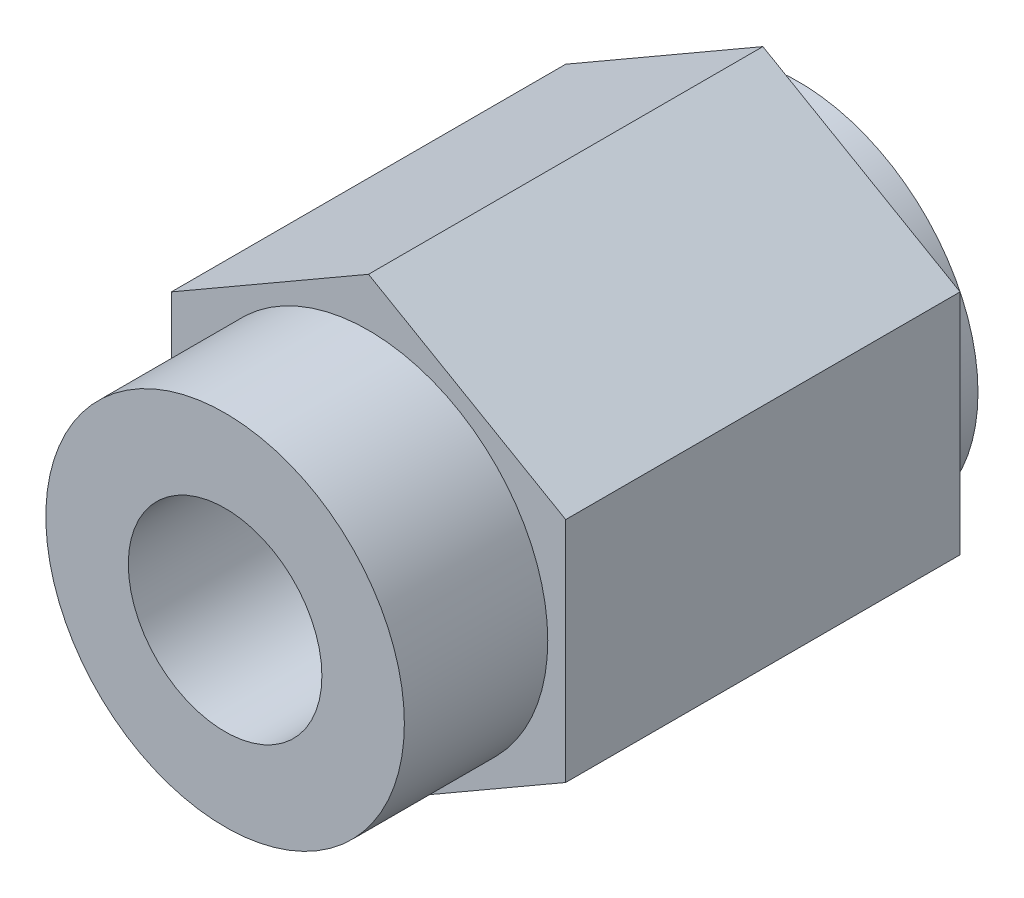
ISO-10303-21;
HEADER;
FILE_DESCRIPTION(('STEP AP214'),'2;1');
FILE_NAME('part.step','',(''),(''),'','','');
FILE_SCHEMA(('AUTOMOTIVE_DESIGN { 1 0 10303 214 1 1 1 1 }'));
ENDSEC;
DATA;
#1=APPLICATION_CONTEXT('core data for automotive mechanical design processes');
#2=APPLICATION_PROTOCOL_DEFINITION('international standard','automotive_design',2000,#1);
#3=PRODUCT_CONTEXT('',#1,'mechanical');
#4=PRODUCT('Part','Part','',(#3));
#5=PRODUCT_RELATED_PRODUCT_CATEGORY('part','',(#4));
#6=PRODUCT_DEFINITION_FORMATION('','',#4);
#7=PRODUCT_DEFINITION_CONTEXT('part definition',#1,'design');
#8=PRODUCT_DEFINITION('design','',#6,#7);
#9=PRODUCT_DEFINITION_SHAPE('','',#8);
#10=(LENGTH_UNIT() NAMED_UNIT(*) SI_UNIT(.MILLI.,.METRE.));
#11=(NAMED_UNIT(*) PLANE_ANGLE_UNIT() SI_UNIT($,.RADIAN.));
#12=(NAMED_UNIT(*) SI_UNIT($,.STERADIAN.) SOLID_ANGLE_UNIT());
#13=UNCERTAINTY_MEASURE_WITH_UNIT(LENGTH_MEASURE(1.E-05),#10,'distance_accuracy_value','');
#14=(GEOMETRIC_REPRESENTATION_CONTEXT(3) GLOBAL_UNCERTAINTY_ASSIGNED_CONTEXT((#13)) GLOBAL_UNIT_ASSIGNED_CONTEXT((#10,
#11,#12)) REPRESENTATION_CONTEXT('',''));
#15=CARTESIAN_POINT('',(0.,0.,0.));
#16=DIRECTION('',(0.,0.,1.));
#17=DIRECTION('',(1.,0.,0.));
#18=AXIS2_PLACEMENT_3D('',#15,#16,#17);
#19=CARTESIAN_POINT('',(27.5,15.8771324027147,55.));
#20=DIRECTION('',(-0.5,-0.866025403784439,0.));
#21=DIRECTION('',(0.866025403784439,-0.5,0.));
#22=AXIS2_PLACEMENT_3D('',#19,#20,#21);
#23=PLANE('',#22);
#24=DIRECTION('',(-0.866025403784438,0.5,0.));
#25=VECTOR('',#24,1.);
#26=CARTESIAN_POINT('',(27.5,15.8771324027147,0.));
#27=LINE('',#26,#25);
#28=CARTESIAN_POINT('',(27.5,15.8771324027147,0.));
#29=VERTEX_POINT('',#28);
#30=CARTESIAN_POINT('',(0.,31.7542648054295,0.));
#31=VERTEX_POINT('',#30);
#32=EDGE_CURVE('E121',#29,#31,#27,.T.);
#33=ORIENTED_EDGE('',*,*,#32,.T.);
#34=DIRECTION('',(0.,0.,-1.));
#35=VECTOR('',#34,1.);
#36=CARTESIAN_POINT('',(0.,31.7542648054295,55.));
#37=LINE('',#36,#35);
#38=CARTESIAN_POINT('',(0.,31.7542648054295,55.));
#39=VERTEX_POINT('',#38);
#40=EDGE_CURVE('E44',#39,#31,#37,.T.);
#41=ORIENTED_EDGE('',*,*,#40,.F.);
#42=DIRECTION('',(-0.866025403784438,0.5,0.));
#43=VECTOR('',#42,1.);
#44=CARTESIAN_POINT('',(27.5,15.8771324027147,55.));
#45=LINE('',#44,#43);
#46=CARTESIAN_POINT('',(27.5,15.8771324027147,55.));
#47=VERTEX_POINT('',#46);
#48=EDGE_CURVE('E132',#47,#39,#45,.T.);
#49=ORIENTED_EDGE('',*,*,#48,.F.);
#50=DIRECTION('',(0.,0.,-1.));
#51=VECTOR('',#50,1.);
#52=CARTESIAN_POINT('',(27.5,15.8771324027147,55.));
#53=LINE('',#52,#51);
#54=EDGE_CURVE('E117',#47,#29,#53,.T.);
#55=ORIENTED_EDGE('',*,*,#54,.T.);
#56=EDGE_LOOP('',(#33,#41,#49,#55));
#57=FACE_BOUND('',#56,.T.);
#58=ADVANCED_FACE('F36',(#57),#23,.F.);
#59=CARTESIAN_POINT('',(0.,31.7542648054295,55.));
#60=DIRECTION('',(0.5,-0.866025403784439,0.));
#61=DIRECTION('',(0.866025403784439,0.5,0.));
#62=AXIS2_PLACEMENT_3D('',#59,#60,#61);
#63=PLANE('',#62);
#64=DIRECTION('',(-0.866025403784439,-0.5,0.));
#65=VECTOR('',#64,1.);
#66=CARTESIAN_POINT('',(0.,31.7542648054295,0.));
#67=LINE('',#66,#65);
#68=CARTESIAN_POINT('',(-27.5,15.8771324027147,0.));
#69=VERTEX_POINT('',#68);
#70=EDGE_CURVE('E124',#31,#69,#67,.T.);
#71=ORIENTED_EDGE('',*,*,#70,.T.);
#72=DIRECTION('',(0.,0.,-1.));
#73=VECTOR('',#72,1.);
#74=CARTESIAN_POINT('',(-27.5,15.8771324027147,55.));
#75=LINE('',#74,#73);
#76=CARTESIAN_POINT('',(-27.5,15.8771324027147,55.));
#77=VERTEX_POINT('',#76);
#78=EDGE_CURVE('E136',#77,#69,#75,.T.);
#79=ORIENTED_EDGE('',*,*,#78,.F.);
#80=DIRECTION('',(-0.866025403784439,-0.5,0.));
#81=VECTOR('',#80,1.);
#82=CARTESIAN_POINT('',(0.,31.7542648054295,55.));
#83=LINE('',#82,#81);
#84=EDGE_CURVE('E90',#39,#77,#83,.T.);
#85=ORIENTED_EDGE('',*,*,#84,.F.);
#86=ORIENTED_EDGE('',*,*,#40,.T.);
#87=EDGE_LOOP('',(#71,#79,#85,#86));
#88=FACE_BOUND('',#87,.T.);
#89=ADVANCED_FACE('F139',(#88),#63,.F.);
#90=CARTESIAN_POINT('',(-27.5,15.8771324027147,55.));
#91=DIRECTION('',(1.,0.,0.));
#92=DIRECTION('',(0.,1.,0.));
#93=AXIS2_PLACEMENT_3D('',#90,#91,#92);
#94=PLANE('',#93);
#95=DIRECTION('',(0.,-1.,0.));
#96=VECTOR('',#95,1.);
#97=CARTESIAN_POINT('',(-27.5,15.8771324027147,0.));
#98=LINE('',#97,#96);
#99=CARTESIAN_POINT('',(-27.5,-15.8771324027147,0.));
#100=VERTEX_POINT('',#99);
#101=EDGE_CURVE('E127',#69,#100,#98,.T.);
#102=ORIENTED_EDGE('',*,*,#101,.T.);
#103=DIRECTION('',(0.,0.,-1.));
#104=VECTOR('',#103,1.);
#105=CARTESIAN_POINT('',(-27.5,-15.8771324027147,55.));
#106=LINE('',#105,#104);
#107=CARTESIAN_POINT('',(-27.5,-15.8771324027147,55.));
#108=VERTEX_POINT('',#107);
#109=EDGE_CURVE('E112',#108,#100,#106,.T.);
#110=ORIENTED_EDGE('',*,*,#109,.F.);
#111=DIRECTION('',(0.,-1.,0.));
#112=VECTOR('',#111,1.);
#113=CARTESIAN_POINT('',(-27.5,15.8771324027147,55.));
#114=LINE('',#113,#112);
#115=EDGE_CURVE('E103',#77,#108,#114,.T.);
#116=ORIENTED_EDGE('',*,*,#115,.F.);
#117=ORIENTED_EDGE('',*,*,#78,.T.);
#118=EDGE_LOOP('',(#102,#110,#116,#117));
#119=FACE_BOUND('',#118,.T.);
#120=ADVANCED_FACE('F147',(#119),#94,.F.);
#121=CARTESIAN_POINT('',(-27.5,-15.8771324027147,55.));
#122=DIRECTION('',(0.5,0.866025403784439,0.));
#123=DIRECTION('',(-0.866025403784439,0.5,0.));
#124=AXIS2_PLACEMENT_3D('',#121,#122,#123);
#125=PLANE('',#124);
#126=DIRECTION('',(0.866025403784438,-0.5,0.));
#127=VECTOR('',#126,1.);
#128=CARTESIAN_POINT('',(-27.5,-15.8771324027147,0.));
#129=LINE('',#128,#127);
#130=CARTESIAN_POINT('',(0.,-31.7542648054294,0.));
#131=VERTEX_POINT('',#130);
#132=EDGE_CURVE('E111',#100,#131,#129,.T.);
#133=ORIENTED_EDGE('',*,*,#132,.T.);
#134=DIRECTION('',(0.,0.,-1.));
#135=VECTOR('',#134,1.);
#136=CARTESIAN_POINT('',(0.,-31.7542648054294,55.));
#137=LINE('',#136,#135);
#138=CARTESIAN_POINT('',(0.,-31.7542648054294,55.));
#139=VERTEX_POINT('',#138);
#140=EDGE_CURVE('E108',#139,#131,#137,.T.);
#141=ORIENTED_EDGE('',*,*,#140,.F.);
#142=DIRECTION('',(0.866025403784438,-0.5,0.));
#143=VECTOR('',#142,1.);
#144=CARTESIAN_POINT('',(-27.5,-15.8771324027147,55.));
#145=LINE('',#144,#143);
#146=EDGE_CURVE('E97',#108,#139,#145,.T.);
#147=ORIENTED_EDGE('',*,*,#146,.F.);
#148=ORIENTED_EDGE('',*,*,#109,.T.);
#149=EDGE_LOOP('',(#133,#141,#147,#148));
#150=FACE_BOUND('',#149,.T.);
#151=ADVANCED_FACE('F109',(#150),#125,.F.);
#152=CARTESIAN_POINT('',(0.,-31.7542648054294,55.));
#153=DIRECTION('',(-0.5,0.866025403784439,0.));
#154=DIRECTION('',(-0.866025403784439,-0.5,0.));
#155=AXIS2_PLACEMENT_3D('',#152,#153,#154);
#156=PLANE('',#155);
#157=DIRECTION('',(0.866025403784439,0.5,0.));
#158=VECTOR('',#157,1.);
#159=CARTESIAN_POINT('',(0.,-31.7542648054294,0.));
#160=LINE('',#159,#158);
#161=CARTESIAN_POINT('',(27.5,-15.8771324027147,0.));
#162=VERTEX_POINT('',#161);
#163=EDGE_CURVE('E75',#131,#162,#160,.T.);
#164=ORIENTED_EDGE('',*,*,#163,.T.);
#165=DIRECTION('',(0.,0.,-1.));
#166=VECTOR('',#165,1.);
#167=CARTESIAN_POINT('',(27.5,-15.8771324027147,55.));
#168=LINE('',#167,#166);
#169=CARTESIAN_POINT('',(27.5,-15.8771324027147,55.));
#170=VERTEX_POINT('',#169);
#171=EDGE_CURVE('E113',#170,#162,#168,.T.);
#172=ORIENTED_EDGE('',*,*,#171,.F.);
#173=DIRECTION('',(0.866025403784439,0.5,0.));
#174=VECTOR('',#173,1.);
#175=CARTESIAN_POINT('',(0.,-31.7542648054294,55.));
#176=LINE('',#175,#174);
#177=EDGE_CURVE('E101',#139,#170,#176,.T.);
#178=ORIENTED_EDGE('',*,*,#177,.F.);
#179=ORIENTED_EDGE('',*,*,#140,.T.);
#180=EDGE_LOOP('',(#164,#172,#178,#179));
#181=FACE_BOUND('',#180,.T.);
#182=ADVANCED_FACE('F115',(#181),#156,.F.);
#183=CARTESIAN_POINT('',(27.5,-15.8771324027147,55.));
#184=DIRECTION('',(-1.,0.,0.));
#185=DIRECTION('',(0.,0.,1.));
#186=AXIS2_PLACEMENT_3D('',#183,#184,#185);
#187=PLANE('',#186);
#188=DIRECTION('',(0.,1.,0.));
#189=VECTOR('',#188,1.);
#190=CARTESIAN_POINT('',(27.5,-15.8771324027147,0.));
#191=LINE('',#190,#189);
#192=EDGE_CURVE('E81',#162,#29,#191,.T.);
#193=ORIENTED_EDGE('',*,*,#192,.T.);
#194=ORIENTED_EDGE('',*,*,#54,.F.);
#195=DIRECTION('',(0.,1.,0.));
#196=VECTOR('',#195,1.);
#197=CARTESIAN_POINT('',(27.5,-15.8771324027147,55.));
#198=LINE('',#197,#196);
#199=EDGE_CURVE('E52',#170,#47,#198,.T.);
#200=ORIENTED_EDGE('',*,*,#199,.F.);
#201=ORIENTED_EDGE('',*,*,#171,.T.);
#202=EDGE_LOOP('',(#193,#194,#200,#201));
#203=FACE_BOUND('',#202,.T.);
#204=ADVANCED_FACE('F195',(#203),#187,.F.);
#205=CARTESIAN_POINT('',(0.,0.,55.));
#206=DIRECTION('',(0.,0.,1.));
#207=DIRECTION('',(1.,0.,0.));
#208=AXIS2_PLACEMENT_3D('',#205,#206,#207);
#209=PLANE('',#208);
#210=CARTESIAN_POINT('',(0.,0.,55.));
#211=DIRECTION('',(0.,0.,1.));
#212=DIRECTION('',(1.,0.,0.));
#213=AXIS2_PLACEMENT_3D('',#210,#211,#212);
#214=CIRCLE('',#213,25.);
#215=CARTESIAN_POINT('',(25.,0.,55.));
#216=VERTEX_POINT('',#215);
#217=EDGE_CURVE('E151',#216,#216,#214,.T.);
#218=ORIENTED_EDGE('',*,*,#217,.F.);
#219=EDGE_LOOP('',(#218));
#220=FACE_BOUND('',#219,.T.);
#221=ORIENTED_EDGE('',*,*,#48,.T.);
#222=ORIENTED_EDGE('',*,*,#84,.T.);
#223=ORIENTED_EDGE('',*,*,#115,.T.);
#224=ORIENTED_EDGE('',*,*,#146,.T.);
#225=ORIENTED_EDGE('',*,*,#177,.T.);
#226=ORIENTED_EDGE('',*,*,#199,.T.);
#227=EDGE_LOOP('',(#221,#222,#223,#224,#225,#226));
#228=FACE_BOUND('',#227,.T.);
#229=ADVANCED_FACE('F99',(#220,#228),#209,.T.);
#230=CARTESIAN_POINT('',(0.,0.,0.));
#231=DIRECTION('',(0.,0.,1.));
#232=DIRECTION('',(1.,0.,0.));
#233=AXIS2_PLACEMENT_3D('',#230,#231,#232);
#234=PLANE('',#233);
#235=CARTESIAN_POINT('',(0.,0.,0.));
#236=DIRECTION('',(0.,0.,1.));
#237=DIRECTION('',(1.,0.,0.));
#238=AXIS2_PLACEMENT_3D('',#235,#236,#237);
#239=CIRCLE('',#238,25.);
#240=CARTESIAN_POINT('',(25.,0.,0.));
#241=VERTEX_POINT('',#240);
#242=EDGE_CURVE('E11',#241,#241,#239,.F.);
#243=ORIENTED_EDGE('',*,*,#242,.F.);
#244=EDGE_LOOP('',(#243));
#245=FACE_BOUND('',#244,.T.);
#246=ORIENTED_EDGE('',*,*,#32,.F.);
#247=ORIENTED_EDGE('',*,*,#192,.F.);
#248=ORIENTED_EDGE('',*,*,#163,.F.);
#249=ORIENTED_EDGE('',*,*,#132,.F.);
#250=ORIENTED_EDGE('',*,*,#101,.F.);
#251=ORIENTED_EDGE('',*,*,#70,.F.);
#252=EDGE_LOOP('',(#246,#247,#248,#249,#250,#251));
#253=FACE_BOUND('',#252,.T.);
#254=ADVANCED_FACE('F144',(#245,#253),#234,.F.);
#255=CARTESIAN_POINT('',(0.,0.,75.));
#256=DIRECTION('',(0.,0.,-1.));
#257=DIRECTION('',(-1.,0.,0.));
#258=AXIS2_PLACEMENT_3D('',#255,#256,#257);
#259=CYLINDRICAL_SURFACE('',#258,25.);
#260=CARTESIAN_POINT('',(0.,0.,75.));
#261=DIRECTION('',(0.,0.,1.));
#262=DIRECTION('',(1.,0.,0.));
#263=AXIS2_PLACEMENT_3D('',#260,#261,#262);
#264=CIRCLE('',#263,25.);
#265=CARTESIAN_POINT('',(25.,0.,75.));
#266=VERTEX_POINT('',#265);
#267=EDGE_CURVE('E125',#266,#266,#264,.T.);
#268=ORIENTED_EDGE('',*,*,#267,.F.);
#269=EDGE_LOOP('',(#268));
#270=FACE_BOUND('',#269,.T.);
#271=ORIENTED_EDGE('',*,*,#217,.T.);
#272=EDGE_LOOP('',(#271));
#273=FACE_BOUND('',#272,.T.);
#274=ADVANCED_FACE('F185',(#270,#273),#259,.T.);
#275=CARTESIAN_POINT('',(0.,0.,75.));
#276=DIRECTION('',(0.,0.,1.));
#277=DIRECTION('',(1.,0.,0.));
#278=AXIS2_PLACEMENT_3D('',#275,#276,#277);
#279=PLANE('',#278);
#280=CARTESIAN_POINT('',(0.,0.,75.));
#281=DIRECTION('',(0.,0.,1.));
#282=DIRECTION('',(1.,0.,0.));
#283=AXIS2_PLACEMENT_3D('',#280,#281,#282);
#284=CIRCLE('',#283,13.5);
#285=CARTESIAN_POINT('',(13.5,0.,75.));
#286=VERTEX_POINT('',#285);
#287=EDGE_CURVE('E166',#286,#286,#284,.T.);
#288=ORIENTED_EDGE('',*,*,#287,.F.);
#289=EDGE_LOOP('',(#288));
#290=FACE_BOUND('',#289,.T.);
#291=ORIENTED_EDGE('',*,*,#267,.T.);
#292=EDGE_LOOP('',(#291));
#293=FACE_BOUND('',#292,.T.);
#294=ADVANCED_FACE('F181',(#290,#293),#279,.T.);
#295=CARTESIAN_POINT('',(0.,0.,-5.));
#296=DIRECTION('',(0.,0.,1.));
#297=DIRECTION('',(1.,0.,0.));
#298=AXIS2_PLACEMENT_3D('',#295,#296,#297);
#299=CYLINDRICAL_SURFACE('',#298,25.);
#300=CARTESIAN_POINT('',(0.,0.,-5.));
#301=DIRECTION('',(0.,0.,-1.));
#302=DIRECTION('',(-1.,0.,0.));
#303=AXIS2_PLACEMENT_3D('',#300,#301,#302);
#304=CIRCLE('',#303,25.);
#305=CARTESIAN_POINT('',(-25.,0.,-5.));
#306=VERTEX_POINT('',#305);
#307=EDGE_CURVE('E154',#306,#306,#304,.T.);
#308=ORIENTED_EDGE('',*,*,#307,.F.);
#309=EDGE_LOOP('',(#308));
#310=FACE_BOUND('',#309,.T.);
#311=ORIENTED_EDGE('',*,*,#242,.T.);
#312=EDGE_LOOP('',(#311));
#313=FACE_BOUND('',#312,.T.);
#314=ADVANCED_FACE('F184',(#310,#313),#299,.T.);
#315=CARTESIAN_POINT('',(0.,0.,-5.));
#316=DIRECTION('',(0.,0.,-1.));
#317=DIRECTION('',(-1.,0.,0.));
#318=AXIS2_PLACEMENT_3D('',#315,#316,#317);
#319=PLANE('',#318);
#320=CARTESIAN_POINT('',(0.,0.,-5.));
#321=DIRECTION('',(0.,0.,-1.));
#322=DIRECTION('',(-1.,0.,0.));
#323=AXIS2_PLACEMENT_3D('',#320,#321,#322);
#324=CIRCLE('',#323,10.);
#325=CARTESIAN_POINT('',(-10.,0.,-5.));
#326=VERTEX_POINT('',#325);
#327=EDGE_CURVE('E159',#326,#326,#324,.T.);
#328=ORIENTED_EDGE('',*,*,#327,.F.);
#329=EDGE_LOOP('',(#328));
#330=FACE_BOUND('',#329,.T.);
#331=ORIENTED_EDGE('',*,*,#307,.T.);
#332=EDGE_LOOP('',(#331));
#333=FACE_BOUND('',#332,.T.);
#334=ADVANCED_FACE('F250',(#330,#333),#319,.T.);
#335=CARTESIAN_POINT('',(0.,0.,35.));
#336=DIRECTION('',(0.,0.,-1.));
#337=DIRECTION('',(-1.,0.,0.));
#338=AXIS2_PLACEMENT_3D('',#335,#336,#337);
#339=CYLINDRICAL_SURFACE('',#338,10.);
#340=CARTESIAN_POINT('',(0.,0.,35.));
#341=DIRECTION('',(0.,0.,1.));
#342=DIRECTION('',(1.,0.,0.));
#343=AXIS2_PLACEMENT_3D('',#340,#341,#342);
#344=CIRCLE('',#343,10.);
#345=CARTESIAN_POINT('',(10.,0.,35.));
#346=VERTEX_POINT('',#345);
#347=EDGE_CURVE('E162',#346,#346,#344,.F.);
#348=ORIENTED_EDGE('',*,*,#347,.F.);
#349=EDGE_LOOP('',(#348));
#350=FACE_BOUND('',#349,.T.);
#351=ORIENTED_EDGE('',*,*,#327,.T.);
#352=EDGE_LOOP('',(#351));
#353=FACE_BOUND('',#352,.T.);
#354=ADVANCED_FACE('F260',(#350,#353),#339,.F.);
#355=CARTESIAN_POINT('',(0.,0.,35.));
#356=DIRECTION('',(0.,0.,1.));
#357=DIRECTION('',(1.,0.,0.));
#358=AXIS2_PLACEMENT_3D('',#355,#356,#357);
#359=PLANE('',#358);
#360=CARTESIAN_POINT('',(0.,0.,35.));
#361=DIRECTION('',(0.,0.,1.));
#362=DIRECTION('',(1.,0.,0.));
#363=AXIS2_PLACEMENT_3D('',#360,#361,#362);
#364=CIRCLE('',#363,13.5);
#365=CARTESIAN_POINT('',(13.5,0.,35.));
#366=VERTEX_POINT('',#365);
#367=EDGE_CURVE('E165',#366,#366,#364,.T.);
#368=ORIENTED_EDGE('',*,*,#367,.T.);
#369=EDGE_LOOP('',(#368));
#370=FACE_BOUND('',#369,.T.);
#371=ORIENTED_EDGE('',*,*,#347,.T.);
#372=EDGE_LOOP('',(#371));
#373=FACE_BOUND('',#372,.T.);
#374=ADVANCED_FACE('F172',(#370,#373),#359,.T.);
#375=CARTESIAN_POINT('',(0.,0.,35.));
#376=DIRECTION('',(0.,0.,1.));
#377=DIRECTION('',(1.,0.,0.));
#378=AXIS2_PLACEMENT_3D('',#375,#376,#377);
#379=CYLINDRICAL_SURFACE('',#378,13.5);
#380=ORIENTED_EDGE('',*,*,#367,.F.);
#381=EDGE_LOOP('',(#380));
#382=FACE_BOUND('',#381,.T.);
#383=ORIENTED_EDGE('',*,*,#287,.T.);
#384=EDGE_LOOP('',(#383));
#385=FACE_BOUND('',#384,.T.);
#386=ADVANCED_FACE('F175',(#382,#385),#379,.F.);
#387=CLOSED_SHELL('',(#58,#89,#120,#151,#182,#204,#229,#254,#274,#294,#314,#334,#354,#374,#386));
#388=MANIFOLD_SOLID_BREP('B2',#387);
#389=ADVANCED_BREP_SHAPE_REPRESENTATION('',(#18,#388),#14);
#390=SHAPE_DEFINITION_REPRESENTATION(#9,#389);
ENDSEC;
END-ISO-10303-21;
